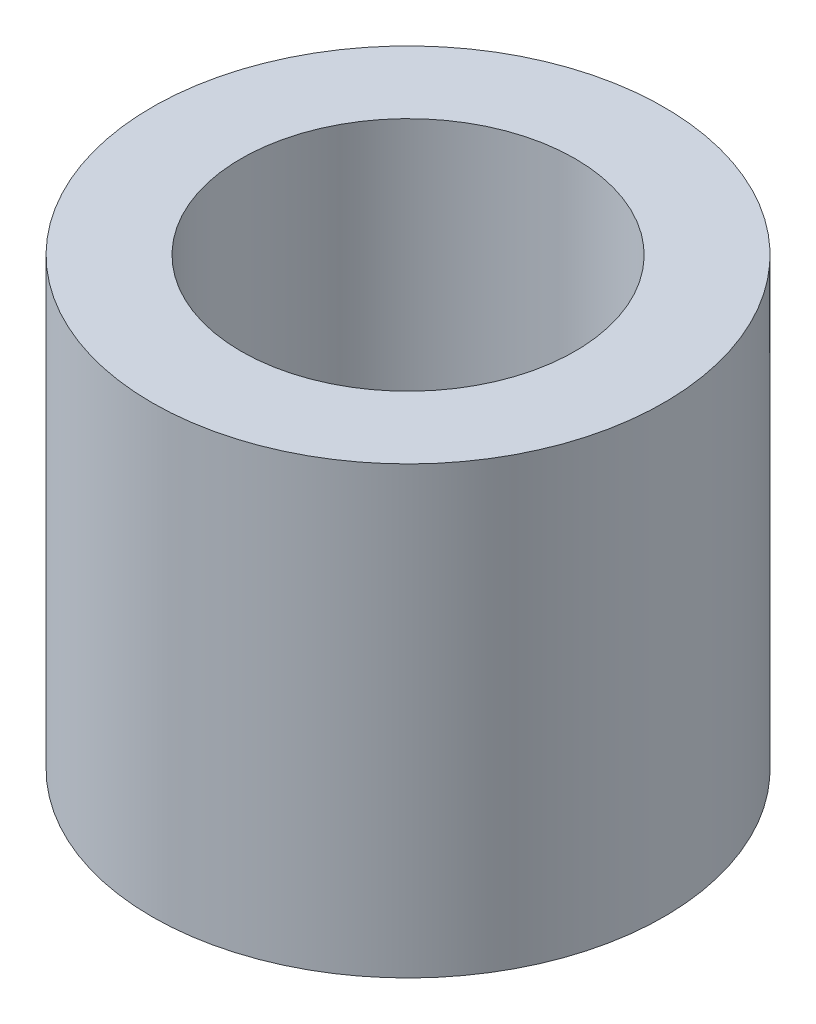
ISO-10303-21;
HEADER;
FILE_DESCRIPTION(('STEP AP214'),'2;1');
FILE_NAME('part.step','',(''),(''),'','','');
FILE_SCHEMA(('AUTOMOTIVE_DESIGN { 1 0 10303 214 1 1 1 1 }'));
ENDSEC;
DATA;
#1=APPLICATION_CONTEXT('core data for automotive mechanical design processes');
#2=APPLICATION_PROTOCOL_DEFINITION('international standard','automotive_design',2000,#1);
#3=PRODUCT_CONTEXT('',#1,'mechanical');
#4=PRODUCT('Part','Part','',(#3));
#5=PRODUCT_RELATED_PRODUCT_CATEGORY('part','',(#4));
#6=PRODUCT_DEFINITION_FORMATION('','',#4);
#7=PRODUCT_DEFINITION_CONTEXT('part definition',#1,'design');
#8=PRODUCT_DEFINITION('design','',#6,#7);
#9=PRODUCT_DEFINITION_SHAPE('','',#8);
#10=(LENGTH_UNIT() NAMED_UNIT(*) SI_UNIT(.MILLI.,.METRE.));
#11=(NAMED_UNIT(*) PLANE_ANGLE_UNIT() SI_UNIT($,.RADIAN.));
#12=(NAMED_UNIT(*) SI_UNIT($,.STERADIAN.) SOLID_ANGLE_UNIT());
#13=UNCERTAINTY_MEASURE_WITH_UNIT(LENGTH_MEASURE(1.E-05),#10,'distance_accuracy_value','');
#14=(GEOMETRIC_REPRESENTATION_CONTEXT(3) GLOBAL_UNCERTAINTY_ASSIGNED_CONTEXT((#13)) GLOBAL_UNIT_ASSIGNED_CONTEXT((#10,
#11,#12)) REPRESENTATION_CONTEXT('',''));
#15=CARTESIAN_POINT('',(0.,0.,0.));
#16=DIRECTION('',(0.,0.,1.));
#17=DIRECTION('',(1.,0.,0.));
#18=AXIS2_PLACEMENT_3D('',#15,#16,#17);
#19=CARTESIAN_POINT('',(0.,4.,0.));
#20=DIRECTION('',(0.,1.,0.));
#21=DIRECTION('',(0.,0.,1.));
#22=AXIS2_PLACEMENT_3D('',#19,#20,#21);
#23=PLANE('',#22);
#24=CARTESIAN_POINT('',(0.,4.,0.));
#25=DIRECTION('',(0.,1.,0.));
#26=DIRECTION('',(0.,0.,1.));
#27=AXIS2_PLACEMENT_3D('',#24,#25,#26);
#28=CIRCLE('',#27,2.3);
#29=CARTESIAN_POINT('',(0.,4.,2.3));
#30=VERTEX_POINT('',#29);
#31=EDGE_CURVE('E10',#30,#30,#28,.T.);
#32=ORIENTED_EDGE('',*,*,#31,.T.);
#33=EDGE_LOOP('',(#32));
#34=FACE_BOUND('',#33,.T.);
#35=CARTESIAN_POINT('',(0.,4.,0.));
#36=DIRECTION('',(0.,1.,0.));
#37=DIRECTION('',(0.,0.,1.));
#38=AXIS2_PLACEMENT_3D('',#35,#36,#37);
#39=CIRCLE('',#38,1.5);
#40=CARTESIAN_POINT('',(0.,4.,1.5));
#41=VERTEX_POINT('',#40);
#42=EDGE_CURVE('E43',#41,#41,#39,.T.);
#43=ORIENTED_EDGE('',*,*,#42,.F.);
#44=EDGE_LOOP('',(#43));
#45=FACE_BOUND('',#44,.T.);
#46=ADVANCED_FACE('F32',(#34,#45),#23,.T.);
#47=CARTESIAN_POINT('',(0.,0.,0.));
#48=DIRECTION('',(0.,1.,0.));
#49=DIRECTION('',(0.,0.,1.));
#50=AXIS2_PLACEMENT_3D('',#47,#48,#49);
#51=PLANE('',#50);
#52=CARTESIAN_POINT('',(0.,0.,0.));
#53=DIRECTION('',(0.,1.,0.));
#54=DIRECTION('',(0.,0.,1.));
#55=AXIS2_PLACEMENT_3D('',#52,#53,#54);
#56=CIRCLE('',#55,2.3);
#57=CARTESIAN_POINT('',(0.,0.,2.3));
#58=VERTEX_POINT('',#57);
#59=EDGE_CURVE('E36',#58,#58,#56,.T.);
#60=ORIENTED_EDGE('',*,*,#59,.F.);
#61=EDGE_LOOP('',(#60));
#62=FACE_BOUND('',#61,.T.);
#63=CARTESIAN_POINT('',(0.,0.,0.));
#64=DIRECTION('',(0.,1.,0.));
#65=DIRECTION('',(0.,0.,1.));
#66=AXIS2_PLACEMENT_3D('',#63,#64,#65);
#67=CIRCLE('',#66,1.5);
#68=CARTESIAN_POINT('',(0.,0.,1.5));
#69=VERTEX_POINT('',#68);
#70=EDGE_CURVE('E45',#69,#69,#67,.T.);
#71=ORIENTED_EDGE('',*,*,#70,.T.);
#72=EDGE_LOOP('',(#71));
#73=FACE_BOUND('',#72,.T.);
#74=ADVANCED_FACE('F55',(#62,#73),#51,.F.);
#75=CARTESIAN_POINT('',(0.,4.,0.));
#76=DIRECTION('',(0.,-1.,0.));
#77=DIRECTION('',(0.,0.,-1.));
#78=AXIS2_PLACEMENT_3D('',#75,#76,#77);
#79=CYLINDRICAL_SURFACE('',#78,2.3);
#80=ORIENTED_EDGE('',*,*,#31,.F.);
#81=EDGE_LOOP('',(#80));
#82=FACE_BOUND('',#81,.T.);
#83=ORIENTED_EDGE('',*,*,#59,.T.);
#84=EDGE_LOOP('',(#83));
#85=FACE_BOUND('',#84,.T.);
#86=ADVANCED_FACE('F34',(#82,#85),#79,.T.);
#87=CARTESIAN_POINT('',(0.,4.,0.));
#88=DIRECTION('',(0.,-1.,0.));
#89=DIRECTION('',(0.,0.,-1.));
#90=AXIS2_PLACEMENT_3D('',#87,#88,#89);
#91=CYLINDRICAL_SURFACE('',#90,1.5);
#92=ORIENTED_EDGE('',*,*,#42,.T.);
#93=EDGE_LOOP('',(#92));
#94=FACE_BOUND('',#93,.T.);
#95=ORIENTED_EDGE('',*,*,#70,.F.);
#96=EDGE_LOOP('',(#95));
#97=FACE_BOUND('',#96,.T.);
#98=ADVANCED_FACE('F51',(#94,#97),#91,.F.);
#99=CLOSED_SHELL('',(#46,#74,#86,#98));
#100=MANIFOLD_SOLID_BREP('B2',#99);
#101=ADVANCED_BREP_SHAPE_REPRESENTATION('',(#18,#100),#14);
#102=SHAPE_DEFINITION_REPRESENTATION(#9,#101);
ENDSEC;
END-ISO-10303-21;
